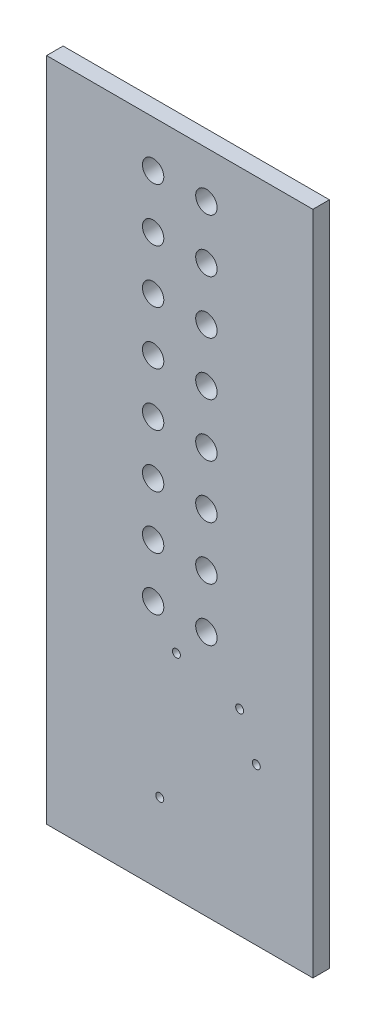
ISO-10303-21;
HEADER;
FILE_DESCRIPTION(('STEP AP214'),'2;1');
FILE_NAME('part.step','',(''),(''),'','','');
FILE_SCHEMA(('AUTOMOTIVE_DESIGN { 1 0 10303 214 1 1 1 1 }'));
ENDSEC;
DATA;
#1=APPLICATION_CONTEXT('core data for automotive mechanical design processes');
#2=APPLICATION_PROTOCOL_DEFINITION('international standard','automotive_design',2000,#1);
#3=PRODUCT_CONTEXT('',#1,'mechanical');
#4=PRODUCT('Part','Part','',(#3));
#5=PRODUCT_RELATED_PRODUCT_CATEGORY('part','',(#4));
#6=PRODUCT_DEFINITION_FORMATION('','',#4);
#7=PRODUCT_DEFINITION_CONTEXT('part definition',#1,'design');
#8=PRODUCT_DEFINITION('design','',#6,#7);
#9=PRODUCT_DEFINITION_SHAPE('','',#8);
#10=(LENGTH_UNIT() NAMED_UNIT(*) SI_UNIT(.MILLI.,.METRE.));
#11=(NAMED_UNIT(*) PLANE_ANGLE_UNIT() SI_UNIT($,.RADIAN.));
#12=(NAMED_UNIT(*) SI_UNIT($,.STERADIAN.) SOLID_ANGLE_UNIT());
#13=UNCERTAINTY_MEASURE_WITH_UNIT(LENGTH_MEASURE(1.E-05),#10,'distance_accuracy_value','');
#14=(GEOMETRIC_REPRESENTATION_CONTEXT(3) GLOBAL_UNCERTAINTY_ASSIGNED_CONTEXT((#13)) GLOBAL_UNIT_ASSIGNED_CONTEXT((#10,
#11,#12)) REPRESENTATION_CONTEXT('',''));
#15=CARTESIAN_POINT('',(0.,0.,0.));
#16=DIRECTION('',(0.,0.,1.));
#17=DIRECTION('',(1.,0.,0.));
#18=AXIS2_PLACEMENT_3D('',#15,#16,#17);
#19=CARTESIAN_POINT('',(12.7,0.,0.7874));
#20=DIRECTION('',(0.,1.,0.));
#21=DIRECTION('',(0.,0.,1.));
#22=AXIS2_PLACEMENT_3D('',#19,#20,#21);
#23=PLANE('',#22);
#24=DIRECTION('',(1.,0.,0.));
#25=VECTOR('',#24,1.);
#26=CARTESIAN_POINT('',(12.7,0.,0.));
#27=LINE('',#26,#25);
#28=CARTESIAN_POINT('',(0.,0.,0.));
#29=VERTEX_POINT('',#28);
#30=CARTESIAN_POINT('',(12.7,0.,0.));
#31=VERTEX_POINT('',#30);
#32=EDGE_CURVE('E99',#29,#31,#27,.T.);
#33=ORIENTED_EDGE('',*,*,#32,.T.);
#34=DIRECTION('',(0.,0.,-1.));
#35=VECTOR('',#34,1.);
#36=CARTESIAN_POINT('',(12.7,0.,0.7874));
#37=LINE('',#36,#35);
#38=CARTESIAN_POINT('',(12.7,0.,0.7874));
#39=VERTEX_POINT('',#38);
#40=EDGE_CURVE('E11',#39,#31,#37,.T.);
#41=ORIENTED_EDGE('',*,*,#40,.F.);
#42=DIRECTION('',(1.,0.,0.));
#43=VECTOR('',#42,1.);
#44=CARTESIAN_POINT('',(12.7,0.,0.7874));
#45=LINE('',#44,#43);
#46=CARTESIAN_POINT('',(0.,0.,0.7874));
#47=VERTEX_POINT('',#46);
#48=EDGE_CURVE('E87',#47,#39,#45,.T.);
#49=ORIENTED_EDGE('',*,*,#48,.F.);
#50=DIRECTION('',(0.,0.,-1.));
#51=VECTOR('',#50,1.);
#52=CARTESIAN_POINT('',(0.,0.,0.7874));
#53=LINE('',#52,#51);
#54=EDGE_CURVE('E95',#47,#29,#53,.T.);
#55=ORIENTED_EDGE('',*,*,#54,.T.);
#56=EDGE_LOOP('',(#33,#41,#49,#55));
#57=FACE_BOUND('',#56,.T.);
#58=ADVANCED_FACE('F36',(#57),#23,.F.);
#59=CARTESIAN_POINT('',(12.7,31.75,0.7874));
#60=DIRECTION('',(-1.,0.,0.));
#61=DIRECTION('',(0.,0.,1.));
#62=AXIS2_PLACEMENT_3D('',#59,#60,#61);
#63=PLANE('',#62);
#64=DIRECTION('',(0.,1.,0.));
#65=VECTOR('',#64,1.);
#66=CARTESIAN_POINT('',(12.7,31.75,0.));
#67=LINE('',#66,#65);
#68=CARTESIAN_POINT('',(12.7,31.75,0.));
#69=VERTEX_POINT('',#68);
#70=EDGE_CURVE('E91',#31,#69,#67,.T.);
#71=ORIENTED_EDGE('',*,*,#70,.T.);
#72=DIRECTION('',(0.,0.,-1.));
#73=VECTOR('',#72,1.);
#74=CARTESIAN_POINT('',(12.7,31.75,0.7874));
#75=LINE('',#74,#73);
#76=CARTESIAN_POINT('',(12.7,31.75,0.7874));
#77=VERTEX_POINT('',#76);
#78=EDGE_CURVE('E44',#77,#69,#75,.T.);
#79=ORIENTED_EDGE('',*,*,#78,.F.);
#80=DIRECTION('',(0.,1.,0.));
#81=VECTOR('',#80,1.);
#82=CARTESIAN_POINT('',(12.7,31.75,0.7874));
#83=LINE('',#82,#81);
#84=EDGE_CURVE('E82',#39,#77,#83,.T.);
#85=ORIENTED_EDGE('',*,*,#84,.F.);
#86=ORIENTED_EDGE('',*,*,#40,.T.);
#87=EDGE_LOOP('',(#71,#79,#85,#86));
#88=FACE_BOUND('',#87,.T.);
#89=ADVANCED_FACE('F90',(#88),#63,.F.);
#90=CARTESIAN_POINT('',(0.,31.75,0.7874));
#91=DIRECTION('',(0.,-1.,0.));
#92=DIRECTION('',(0.,0.,-1.));
#93=AXIS2_PLACEMENT_3D('',#90,#91,#92);
#94=PLANE('',#93);
#95=DIRECTION('',(-1.,0.,0.));
#96=VECTOR('',#95,1.);
#97=CARTESIAN_POINT('',(0.,31.75,0.));
#98=LINE('',#97,#96);
#99=CARTESIAN_POINT('',(0.,31.75,0.));
#100=VERTEX_POINT('',#99);
#101=EDGE_CURVE('E69',#69,#100,#98,.T.);
#102=ORIENTED_EDGE('',*,*,#101,.T.);
#103=DIRECTION('',(0.,0.,-1.));
#104=VECTOR('',#103,1.);
#105=CARTESIAN_POINT('',(0.,31.75,0.7874));
#106=LINE('',#105,#104);
#107=CARTESIAN_POINT('',(0.,31.75,0.7874));
#108=VERTEX_POINT('',#107);
#109=EDGE_CURVE('E92',#108,#100,#106,.T.);
#110=ORIENTED_EDGE('',*,*,#109,.F.);
#111=DIRECTION('',(-1.,0.,0.));
#112=VECTOR('',#111,1.);
#113=CARTESIAN_POINT('',(0.,31.75,0.7874));
#114=LINE('',#113,#112);
#115=EDGE_CURVE('E85',#77,#108,#114,.T.);
#116=ORIENTED_EDGE('',*,*,#115,.F.);
#117=ORIENTED_EDGE('',*,*,#78,.T.);
#118=EDGE_LOOP('',(#102,#110,#116,#117));
#119=FACE_BOUND('',#118,.T.);
#120=ADVANCED_FACE('F93',(#119),#94,.F.);
#121=CARTESIAN_POINT('',(0.,0.,0.7874));
#122=DIRECTION('',(1.,0.,0.));
#123=DIRECTION('',(0.,0.,-1.));
#124=AXIS2_PLACEMENT_3D('',#121,#122,#123);
#125=PLANE('',#124);
#126=DIRECTION('',(0.,-1.,0.));
#127=VECTOR('',#126,1.);
#128=CARTESIAN_POINT('',(0.,0.,0.));
#129=LINE('',#128,#127);
#130=EDGE_CURVE('E75',#100,#29,#129,.T.);
#131=ORIENTED_EDGE('',*,*,#130,.T.);
#132=ORIENTED_EDGE('',*,*,#54,.F.);
#133=DIRECTION('',(0.,-1.,0.));
#134=VECTOR('',#133,1.);
#135=CARTESIAN_POINT('',(0.,0.,0.7874));
#136=LINE('',#135,#134);
#137=EDGE_CURVE('E52',#108,#47,#136,.T.);
#138=ORIENTED_EDGE('',*,*,#137,.F.);
#139=ORIENTED_EDGE('',*,*,#109,.T.);
#140=EDGE_LOOP('',(#131,#132,#138,#139));
#141=FACE_BOUND('',#140,.T.);
#142=ADVANCED_FACE('F107',(#141),#125,.F.);
#143=CARTESIAN_POINT('',(0.,0.,0.7874));
#144=DIRECTION('',(0.,0.,-1.));
#145=DIRECTION('',(-1.,0.,0.));
#146=AXIS2_PLACEMENT_3D('',#143,#144,#145);
#147=PLANE('',#146);
#148=CARTESIAN_POINT('',(7.62,24.45,0.7874));
#149=DIRECTION('',(0.,0.,1.));
#150=DIRECTION('',(1.,0.,0.));
#151=AXIS2_PLACEMENT_3D('',#148,#149,#150);
#152=CIRCLE('',#151,0.51);
#153=CARTESIAN_POINT('',(8.13,24.45,0.7874));
#154=VERTEX_POINT('',#153);
#155=EDGE_CURVE('E147',#154,#154,#152,.T.);
#156=ORIENTED_EDGE('',*,*,#155,.F.);
#157=EDGE_LOOP('',(#156));
#158=FACE_BOUND('',#157,.T.);
#159=CARTESIAN_POINT('',(7.62,26.99,0.7874));
#160=DIRECTION('',(0.,0.,1.));
#161=DIRECTION('',(1.,0.,0.));
#162=AXIS2_PLACEMENT_3D('',#159,#160,#161);
#163=CIRCLE('',#162,0.51);
#164=CARTESIAN_POINT('',(8.13,26.99,0.7874));
#165=VERTEX_POINT('',#164);
#166=EDGE_CURVE('E170',#165,#165,#163,.T.);
#167=ORIENTED_EDGE('',*,*,#166,.F.);
#168=EDGE_LOOP('',(#167));
#169=FACE_BOUND('',#168,.T.);
#170=CARTESIAN_POINT('',(7.62,29.53,0.7874));
#171=DIRECTION('',(0.,0.,1.));
#172=DIRECTION('',(1.,0.,0.));
#173=AXIS2_PLACEMENT_3D('',#170,#171,#172);
#174=CIRCLE('',#173,0.51);
#175=CARTESIAN_POINT('',(8.13,29.53,0.7874));
#176=VERTEX_POINT('',#175);
#177=EDGE_CURVE('E171',#176,#176,#174,.T.);
#178=ORIENTED_EDGE('',*,*,#177,.F.);
#179=EDGE_LOOP('',(#178));
#180=FACE_BOUND('',#179,.T.);
#181=CARTESIAN_POINT('',(5.08,11.75,0.7874));
#182=DIRECTION('',(0.,0.,1.));
#183=DIRECTION('',(1.,0.,0.));
#184=AXIS2_PLACEMENT_3D('',#181,#182,#183);
#185=CIRCLE('',#184,0.51);
#186=CARTESIAN_POINT('',(5.59,11.75,0.7874));
#187=VERTEX_POINT('',#186);
#188=EDGE_CURVE('E182',#187,#187,#185,.T.);
#189=ORIENTED_EDGE('',*,*,#188,.F.);
#190=EDGE_LOOP('',(#189));
#191=FACE_BOUND('',#190,.T.);
#192=CARTESIAN_POINT('',(7.62,21.91,0.7874));
#193=DIRECTION('',(0.,0.,1.));
#194=DIRECTION('',(1.,0.,0.));
#195=AXIS2_PLACEMENT_3D('',#192,#193,#194);
#196=CIRCLE('',#195,0.51);
#197=CARTESIAN_POINT('',(8.13,21.91,0.7874));
#198=VERTEX_POINT('',#197);
#199=EDGE_CURVE('E146',#198,#198,#196,.T.);
#200=ORIENTED_EDGE('',*,*,#199,.F.);
#201=EDGE_LOOP('',(#200));
#202=FACE_BOUND('',#201,.T.);
#203=CARTESIAN_POINT('',(7.62,19.37,0.7874));
#204=DIRECTION('',(0.,0.,1.));
#205=DIRECTION('',(1.,0.,0.));
#206=AXIS2_PLACEMENT_3D('',#203,#204,#205);
#207=CIRCLE('',#206,0.51);
#208=CARTESIAN_POINT('',(8.13,19.37,0.7874));
#209=VERTEX_POINT('',#208);
#210=EDGE_CURVE('E153',#209,#209,#207,.T.);
#211=ORIENTED_EDGE('',*,*,#210,.F.);
#212=EDGE_LOOP('',(#211));
#213=FACE_BOUND('',#212,.T.);
#214=CARTESIAN_POINT('',(7.62,16.83,0.7874));
#215=DIRECTION('',(0.,0.,1.));
#216=DIRECTION('',(1.,0.,0.));
#217=AXIS2_PLACEMENT_3D('',#214,#215,#216);
#218=CIRCLE('',#217,0.51);
#219=CARTESIAN_POINT('',(8.13,16.83,0.7874));
#220=VERTEX_POINT('',#219);
#221=EDGE_CURVE('E159',#220,#220,#218,.T.);
#222=ORIENTED_EDGE('',*,*,#221,.F.);
#223=EDGE_LOOP('',(#222));
#224=FACE_BOUND('',#223,.T.);
#225=CARTESIAN_POINT('',(7.62,14.29,0.7874));
#226=DIRECTION('',(0.,0.,1.));
#227=DIRECTION('',(1.,0.,0.));
#228=AXIS2_PLACEMENT_3D('',#225,#226,#227);
#229=CIRCLE('',#228,0.51);
#230=CARTESIAN_POINT('',(8.13,14.29,0.7874));
#231=VERTEX_POINT('',#230);
#232=EDGE_CURVE('E140',#231,#231,#229,.T.);
#233=ORIENTED_EDGE('',*,*,#232,.F.);
#234=EDGE_LOOP('',(#233));
#235=FACE_BOUND('',#234,.T.);
#236=CARTESIAN_POINT('',(5.08,14.29,0.7874));
#237=DIRECTION('',(0.,0.,1.));
#238=DIRECTION('',(1.,0.,0.));
#239=AXIS2_PLACEMENT_3D('',#236,#237,#238);
#240=CIRCLE('',#239,0.51);
#241=CARTESIAN_POINT('',(5.59,14.29,0.7874));
#242=VERTEX_POINT('',#241);
#243=EDGE_CURVE('E183',#242,#242,#240,.T.);
#244=ORIENTED_EDGE('',*,*,#243,.F.);
#245=EDGE_LOOP('',(#244));
#246=FACE_BOUND('',#245,.T.);
#247=CARTESIAN_POINT('',(5.08,16.83,0.7874));
#248=DIRECTION('',(0.,0.,1.));
#249=DIRECTION('',(1.,0.,0.));
#250=AXIS2_PLACEMENT_3D('',#247,#248,#249);
#251=CIRCLE('',#250,0.51);
#252=CARTESIAN_POINT('',(5.59,16.83,0.7874));
#253=VERTEX_POINT('',#252);
#254=EDGE_CURVE('E224',#253,#253,#251,.T.);
#255=ORIENTED_EDGE('',*,*,#254,.F.);
#256=EDGE_LOOP('',(#255));
#257=FACE_BOUND('',#256,.T.);
#258=CARTESIAN_POINT('',(5.08,19.37,0.7874));
#259=DIRECTION('',(0.,0.,1.));
#260=DIRECTION('',(1.,0.,0.));
#261=AXIS2_PLACEMENT_3D('',#258,#259,#260);
#262=CIRCLE('',#261,0.51);
#263=CARTESIAN_POINT('',(5.59,19.37,0.7874));
#264=VERTEX_POINT('',#263);
#265=EDGE_CURVE('E218',#264,#264,#262,.T.);
#266=ORIENTED_EDGE('',*,*,#265,.F.);
#267=EDGE_LOOP('',(#266));
#268=FACE_BOUND('',#267,.T.);
#269=CARTESIAN_POINT('',(5.08,21.91,0.7874));
#270=DIRECTION('',(0.,0.,1.));
#271=DIRECTION('',(1.,0.,0.));
#272=AXIS2_PLACEMENT_3D('',#269,#270,#271);
#273=CIRCLE('',#272,0.51);
#274=CARTESIAN_POINT('',(5.59,21.91,0.7874));
#275=VERTEX_POINT('',#274);
#276=EDGE_CURVE('E212',#275,#275,#273,.T.);
#277=ORIENTED_EDGE('',*,*,#276,.F.);
#278=EDGE_LOOP('',(#277));
#279=FACE_BOUND('',#278,.T.);
#280=CARTESIAN_POINT('',(5.08,24.45,0.7874));
#281=DIRECTION('',(0.,0.,1.));
#282=DIRECTION('',(1.,0.,0.));
#283=AXIS2_PLACEMENT_3D('',#280,#281,#282);
#284=CIRCLE('',#283,0.51);
#285=CARTESIAN_POINT('',(5.59,24.45,0.7874));
#286=VERTEX_POINT('',#285);
#287=EDGE_CURVE('E206',#286,#286,#284,.T.);
#288=ORIENTED_EDGE('',*,*,#287,.F.);
#289=EDGE_LOOP('',(#288));
#290=FACE_BOUND('',#289,.T.);
#291=CARTESIAN_POINT('',(5.08,26.99,0.7874));
#292=DIRECTION('',(0.,0.,1.));
#293=DIRECTION('',(1.,0.,0.));
#294=AXIS2_PLACEMENT_3D('',#291,#292,#293);
#295=CIRCLE('',#294,0.51);
#296=CARTESIAN_POINT('',(5.59,26.99,0.7874));
#297=VERTEX_POINT('',#296);
#298=EDGE_CURVE('E200',#297,#297,#295,.T.);
#299=ORIENTED_EDGE('',*,*,#298,.F.);
#300=EDGE_LOOP('',(#299));
#301=FACE_BOUND('',#300,.T.);
#302=CARTESIAN_POINT('',(5.08,29.53,0.7874));
#303=DIRECTION('',(0.,0.,1.));
#304=DIRECTION('',(1.,0.,0.));
#305=AXIS2_PLACEMENT_3D('',#302,#303,#304);
#306=CIRCLE('',#305,0.51);
#307=CARTESIAN_POINT('',(5.59,29.53,0.7874));
#308=VERTEX_POINT('',#307);
#309=EDGE_CURVE('E194',#308,#308,#306,.T.);
#310=ORIENTED_EDGE('',*,*,#309,.F.);
#311=EDGE_LOOP('',(#310));
#312=FACE_BOUND('',#311,.T.);
#313=CARTESIAN_POINT('',(7.62,11.75,0.7874));
#314=DIRECTION('',(0.,0.,1.));
#315=DIRECTION('',(1.,0.,0.));
#316=AXIS2_PLACEMENT_3D('',#313,#314,#315);
#317=CIRCLE('',#316,0.51);
#318=CARTESIAN_POINT('',(8.13,11.75,0.7874));
#319=VERTEX_POINT('',#318);
#320=EDGE_CURVE('E117',#319,#319,#317,.T.);
#321=ORIENTED_EDGE('',*,*,#320,.F.);
#322=EDGE_LOOP('',(#321));
#323=FACE_BOUND('',#322,.T.);
#324=CARTESIAN_POINT('',(10.0013,7.4613,0.7874));
#325=DIRECTION('',(0.,0.,1.));
#326=DIRECTION('',(1.,0.,0.));
#327=AXIS2_PLACEMENT_3D('',#324,#325,#326);
#328=CIRCLE('',#327,0.1905);
#329=CARTESIAN_POINT('',(10.1918,7.4613,0.7874));
#330=VERTEX_POINT('',#329);
#331=EDGE_CURVE('E102',#330,#330,#328,.T.);
#332=ORIENTED_EDGE('',*,*,#331,.F.);
#333=EDGE_LOOP('',(#332));
#334=FACE_BOUND('',#333,.T.);
#335=CARTESIAN_POINT('',(9.2075,9.3663,0.7874));
#336=DIRECTION('',(0.,0.,1.));
#337=DIRECTION('',(1.,0.,0.));
#338=AXIS2_PLACEMENT_3D('',#335,#336,#337);
#339=CIRCLE('',#338,0.1905);
#340=CARTESIAN_POINT('',(9.398,9.3663,0.7874));
#341=VERTEX_POINT('',#340);
#342=EDGE_CURVE('E129',#341,#341,#339,.T.);
#343=ORIENTED_EDGE('',*,*,#342,.F.);
#344=EDGE_LOOP('',(#343));
#345=FACE_BOUND('',#344,.T.);
#346=CARTESIAN_POINT('',(5.3975,3.81,0.7874));
#347=DIRECTION('',(0.,0.,1.));
#348=DIRECTION('',(1.,0.,0.));
#349=AXIS2_PLACEMENT_3D('',#346,#347,#348);
#350=CIRCLE('',#349,0.1905);
#351=CARTESIAN_POINT('',(5.588,3.81,0.7874));
#352=VERTEX_POINT('',#351);
#353=EDGE_CURVE('E123',#352,#352,#350,.T.);
#354=ORIENTED_EDGE('',*,*,#353,.F.);
#355=EDGE_LOOP('',(#354));
#356=FACE_BOUND('',#355,.T.);
#357=CARTESIAN_POINT('',(6.1913,10.16,0.7874));
#358=DIRECTION('',(0.,0.,1.));
#359=DIRECTION('',(1.,0.,0.));
#360=AXIS2_PLACEMENT_3D('',#357,#358,#359);
#361=CIRCLE('',#360,0.1905);
#362=CARTESIAN_POINT('',(6.3818,10.16,0.7874));
#363=VERTEX_POINT('',#362);
#364=EDGE_CURVE('E116',#363,#363,#361,.T.);
#365=ORIENTED_EDGE('',*,*,#364,.F.);
#366=EDGE_LOOP('',(#365));
#367=FACE_BOUND('',#366,.T.);
#368=ORIENTED_EDGE('',*,*,#48,.T.);
#369=ORIENTED_EDGE('',*,*,#84,.T.);
#370=ORIENTED_EDGE('',*,*,#115,.T.);
#371=ORIENTED_EDGE('',*,*,#137,.T.);
#372=EDGE_LOOP('',(#368,#369,#370,#371));
#373=FACE_BOUND('',#372,.T.);
#374=ADVANCED_FACE('F83',(#158,#169,#180,#191,#202,#213,#224,#235,#246,#257,#268,#279,#290,#301,
#312,#323,#334,#345,#356,#367,#373),#147,.F.);
#375=CARTESIAN_POINT('',(0.,0.,0.));
#376=DIRECTION('',(0.,0.,-1.));
#377=DIRECTION('',(-1.,0.,0.));
#378=AXIS2_PLACEMENT_3D('',#375,#376,#377);
#379=PLANE('',#378);
#380=CARTESIAN_POINT('',(7.62,24.45,0.));
#381=DIRECTION('',(0.,0.,1.));
#382=DIRECTION('',(1.,0.,0.));
#383=AXIS2_PLACEMENT_3D('',#380,#381,#382);
#384=CIRCLE('',#383,0.51);
#385=CARTESIAN_POINT('',(8.13,24.45,0.));
#386=VERTEX_POINT('',#385);
#387=EDGE_CURVE('E174',#386,#386,#384,.T.);
#388=ORIENTED_EDGE('',*,*,#387,.T.);
#389=EDGE_LOOP('',(#388));
#390=FACE_BOUND('',#389,.T.);
#391=CARTESIAN_POINT('',(7.62,26.99,0.));
#392=DIRECTION('',(0.,0.,1.));
#393=DIRECTION('',(1.,0.,0.));
#394=AXIS2_PLACEMENT_3D('',#391,#392,#393);
#395=CIRCLE('',#394,0.51);
#396=CARTESIAN_POINT('',(8.13,26.99,0.));
#397=VERTEX_POINT('',#396);
#398=EDGE_CURVE('E167',#397,#397,#395,.T.);
#399=ORIENTED_EDGE('',*,*,#398,.T.);
#400=EDGE_LOOP('',(#399));
#401=FACE_BOUND('',#400,.T.);
#402=CARTESIAN_POINT('',(7.62,29.53,0.));
#403=DIRECTION('',(0.,0.,1.));
#404=DIRECTION('',(1.,0.,0.));
#405=AXIS2_PLACEMENT_3D('',#402,#403,#404);
#406=CIRCLE('',#405,0.51);
#407=CARTESIAN_POINT('',(8.13,29.53,0.));
#408=VERTEX_POINT('',#407);
#409=EDGE_CURVE('E186',#408,#408,#406,.T.);
#410=ORIENTED_EDGE('',*,*,#409,.T.);
#411=EDGE_LOOP('',(#410));
#412=FACE_BOUND('',#411,.T.);
#413=CARTESIAN_POINT('',(5.08,11.75,0.));
#414=DIRECTION('',(0.,0.,1.));
#415=DIRECTION('',(1.,0.,0.));
#416=AXIS2_PLACEMENT_3D('',#413,#414,#415);
#417=CIRCLE('',#416,0.51);
#418=CARTESIAN_POINT('',(5.59,11.75,0.));
#419=VERTEX_POINT('',#418);
#420=EDGE_CURVE('E179',#419,#419,#417,.T.);
#421=ORIENTED_EDGE('',*,*,#420,.T.);
#422=EDGE_LOOP('',(#421));
#423=FACE_BOUND('',#422,.T.);
#424=CARTESIAN_POINT('',(7.62,21.91,0.));
#425=DIRECTION('',(0.,0.,1.));
#426=DIRECTION('',(1.,0.,0.));
#427=AXIS2_PLACEMENT_3D('',#424,#425,#426);
#428=CIRCLE('',#427,0.51);
#429=CARTESIAN_POINT('',(8.13,21.91,0.));
#430=VERTEX_POINT('',#429);
#431=EDGE_CURVE('E143',#430,#430,#428,.T.);
#432=ORIENTED_EDGE('',*,*,#431,.T.);
#433=EDGE_LOOP('',(#432));
#434=FACE_BOUND('',#433,.T.);
#435=CARTESIAN_POINT('',(7.62,19.37,0.));
#436=DIRECTION('',(0.,0.,1.));
#437=DIRECTION('',(1.,0.,0.));
#438=AXIS2_PLACEMENT_3D('',#435,#436,#437);
#439=CIRCLE('',#438,0.51);
#440=CARTESIAN_POINT('',(8.13,19.37,0.));
#441=VERTEX_POINT('',#440);
#442=EDGE_CURVE('E150',#441,#441,#439,.T.);
#443=ORIENTED_EDGE('',*,*,#442,.T.);
#444=EDGE_LOOP('',(#443));
#445=FACE_BOUND('',#444,.T.);
#446=CARTESIAN_POINT('',(7.62,16.83,0.));
#447=DIRECTION('',(0.,0.,1.));
#448=DIRECTION('',(1.,0.,0.));
#449=AXIS2_PLACEMENT_3D('',#446,#447,#448);
#450=CIRCLE('',#449,0.51);
#451=CARTESIAN_POINT('',(8.13,16.83,0.));
#452=VERTEX_POINT('',#451);
#453=EDGE_CURVE('E156',#452,#452,#450,.T.);
#454=ORIENTED_EDGE('',*,*,#453,.T.);
#455=EDGE_LOOP('',(#454));
#456=FACE_BOUND('',#455,.T.);
#457=CARTESIAN_POINT('',(7.62,14.29,0.));
#458=DIRECTION('',(0.,0.,1.));
#459=DIRECTION('',(1.,0.,0.));
#460=AXIS2_PLACEMENT_3D('',#457,#458,#459);
#461=CIRCLE('',#460,0.51);
#462=CARTESIAN_POINT('',(8.13,14.29,0.));
#463=VERTEX_POINT('',#462);
#464=EDGE_CURVE('E162',#463,#463,#461,.T.);
#465=ORIENTED_EDGE('',*,*,#464,.T.);
#466=EDGE_LOOP('',(#465));
#467=FACE_BOUND('',#466,.T.);
#468=CARTESIAN_POINT('',(5.08,14.29,0.));
#469=DIRECTION('',(0.,0.,1.));
#470=DIRECTION('',(1.,0.,0.));
#471=AXIS2_PLACEMENT_3D('',#468,#469,#470);
#472=CIRCLE('',#471,0.51);
#473=CARTESIAN_POINT('',(5.59,14.29,0.));
#474=VERTEX_POINT('',#473);
#475=EDGE_CURVE('E227',#474,#474,#472,.T.);
#476=ORIENTED_EDGE('',*,*,#475,.T.);
#477=EDGE_LOOP('',(#476));
#478=FACE_BOUND('',#477,.T.);
#479=CARTESIAN_POINT('',(5.08,16.83,0.));
#480=DIRECTION('',(0.,0.,1.));
#481=DIRECTION('',(1.,0.,0.));
#482=AXIS2_PLACEMENT_3D('',#479,#480,#481);
#483=CIRCLE('',#482,0.51);
#484=CARTESIAN_POINT('',(5.59,16.83,0.));
#485=VERTEX_POINT('',#484);
#486=EDGE_CURVE('E221',#485,#485,#483,.T.);
#487=ORIENTED_EDGE('',*,*,#486,.T.);
#488=EDGE_LOOP('',(#487));
#489=FACE_BOUND('',#488,.T.);
#490=CARTESIAN_POINT('',(5.08,19.37,0.));
#491=DIRECTION('',(0.,0.,1.));
#492=DIRECTION('',(1.,0.,0.));
#493=AXIS2_PLACEMENT_3D('',#490,#491,#492);
#494=CIRCLE('',#493,0.51);
#495=CARTESIAN_POINT('',(5.59,19.37,0.));
#496=VERTEX_POINT('',#495);
#497=EDGE_CURVE('E215',#496,#496,#494,.T.);
#498=ORIENTED_EDGE('',*,*,#497,.T.);
#499=EDGE_LOOP('',(#498));
#500=FACE_BOUND('',#499,.T.);
#501=CARTESIAN_POINT('',(5.08,21.91,0.));
#502=DIRECTION('',(0.,0.,1.));
#503=DIRECTION('',(1.,0.,0.));
#504=AXIS2_PLACEMENT_3D('',#501,#502,#503);
#505=CIRCLE('',#504,0.51);
#506=CARTESIAN_POINT('',(5.59,21.91,0.));
#507=VERTEX_POINT('',#506);
#508=EDGE_CURVE('E209',#507,#507,#505,.T.);
#509=ORIENTED_EDGE('',*,*,#508,.T.);
#510=EDGE_LOOP('',(#509));
#511=FACE_BOUND('',#510,.T.);
#512=CARTESIAN_POINT('',(5.08,24.45,0.));
#513=DIRECTION('',(0.,0.,1.));
#514=DIRECTION('',(1.,0.,0.));
#515=AXIS2_PLACEMENT_3D('',#512,#513,#514);
#516=CIRCLE('',#515,0.51);
#517=CARTESIAN_POINT('',(5.59,24.45,0.));
#518=VERTEX_POINT('',#517);
#519=EDGE_CURVE('E203',#518,#518,#516,.T.);
#520=ORIENTED_EDGE('',*,*,#519,.T.);
#521=EDGE_LOOP('',(#520));
#522=FACE_BOUND('',#521,.T.);
#523=CARTESIAN_POINT('',(5.08,26.99,0.));
#524=DIRECTION('',(0.,0.,1.));
#525=DIRECTION('',(1.,0.,0.));
#526=AXIS2_PLACEMENT_3D('',#523,#524,#525);
#527=CIRCLE('',#526,0.51);
#528=CARTESIAN_POINT('',(5.59,26.99,0.));
#529=VERTEX_POINT('',#528);
#530=EDGE_CURVE('E197',#529,#529,#527,.T.);
#531=ORIENTED_EDGE('',*,*,#530,.T.);
#532=EDGE_LOOP('',(#531));
#533=FACE_BOUND('',#532,.T.);
#534=CARTESIAN_POINT('',(5.08,29.53,0.));
#535=DIRECTION('',(0.,0.,1.));
#536=DIRECTION('',(1.,0.,0.));
#537=AXIS2_PLACEMENT_3D('',#534,#535,#536);
#538=CIRCLE('',#537,0.51);
#539=CARTESIAN_POINT('',(5.59,29.53,0.));
#540=VERTEX_POINT('',#539);
#541=EDGE_CURVE('E191',#540,#540,#538,.T.);
#542=ORIENTED_EDGE('',*,*,#541,.T.);
#543=EDGE_LOOP('',(#542));
#544=FACE_BOUND('',#543,.T.);
#545=CARTESIAN_POINT('',(7.62,11.75,0.));
#546=DIRECTION('',(0.,0.,1.));
#547=DIRECTION('',(1.,0.,0.));
#548=AXIS2_PLACEMENT_3D('',#545,#546,#547);
#549=CIRCLE('',#548,0.51);
#550=CARTESIAN_POINT('',(8.13,11.75,0.));
#551=VERTEX_POINT('',#550);
#552=EDGE_CURVE('E137',#551,#551,#549,.T.);
#553=ORIENTED_EDGE('',*,*,#552,.T.);
#554=EDGE_LOOP('',(#553));
#555=FACE_BOUND('',#554,.T.);
#556=CARTESIAN_POINT('',(10.0013,7.4613,0.));
#557=DIRECTION('',(0.,0.,1.));
#558=DIRECTION('',(1.,0.,0.));
#559=AXIS2_PLACEMENT_3D('',#556,#557,#558);
#560=CIRCLE('',#559,0.1905);
#561=CARTESIAN_POINT('',(10.1918,7.4613,0.));
#562=VERTEX_POINT('',#561);
#563=EDGE_CURVE('E132',#562,#562,#560,.T.);
#564=ORIENTED_EDGE('',*,*,#563,.T.);
#565=EDGE_LOOP('',(#564));
#566=FACE_BOUND('',#565,.T.);
#567=CARTESIAN_POINT('',(9.2075,9.3663,0.));
#568=DIRECTION('',(0.,0.,1.));
#569=DIRECTION('',(1.,0.,0.));
#570=AXIS2_PLACEMENT_3D('',#567,#568,#569);
#571=CIRCLE('',#570,0.1905);
#572=CARTESIAN_POINT('',(9.398,9.3663,0.));
#573=VERTEX_POINT('',#572);
#574=EDGE_CURVE('E126',#573,#573,#571,.T.);
#575=ORIENTED_EDGE('',*,*,#574,.T.);
#576=EDGE_LOOP('',(#575));
#577=FACE_BOUND('',#576,.T.);
#578=CARTESIAN_POINT('',(5.3975,3.81,0.));
#579=DIRECTION('',(0.,0.,1.));
#580=DIRECTION('',(1.,0.,0.));
#581=AXIS2_PLACEMENT_3D('',#578,#579,#580);
#582=CIRCLE('',#581,0.1905);
#583=CARTESIAN_POINT('',(5.588,3.81,0.));
#584=VERTEX_POINT('',#583);
#585=EDGE_CURVE('E120',#584,#584,#582,.T.);
#586=ORIENTED_EDGE('',*,*,#585,.T.);
#587=EDGE_LOOP('',(#586));
#588=FACE_BOUND('',#587,.T.);
#589=CARTESIAN_POINT('',(6.1913,10.16,0.));
#590=DIRECTION('',(0.,0.,1.));
#591=DIRECTION('',(1.,0.,0.));
#592=AXIS2_PLACEMENT_3D('',#589,#590,#591);
#593=CIRCLE('',#592,0.1905);
#594=CARTESIAN_POINT('',(6.3818,10.16,0.));
#595=VERTEX_POINT('',#594);
#596=EDGE_CURVE('E113',#595,#595,#593,.T.);
#597=ORIENTED_EDGE('',*,*,#596,.T.);
#598=EDGE_LOOP('',(#597));
#599=FACE_BOUND('',#598,.T.);
#600=ORIENTED_EDGE('',*,*,#32,.F.);
#601=ORIENTED_EDGE('',*,*,#130,.F.);
#602=ORIENTED_EDGE('',*,*,#101,.F.);
#603=ORIENTED_EDGE('',*,*,#70,.F.);
#604=EDGE_LOOP('',(#600,#601,#602,#603));
#605=FACE_BOUND('',#604,.T.);
#606=ADVANCED_FACE('F110',(#390,#401,#412,#423,#434,#445,#456,#467,#478,#489,#500,#511,#522,
#533,#544,#555,#566,#577,#588,#599,#605),#379,.T.);
#607=CARTESIAN_POINT('',(6.1913,10.16,0.7874));
#608=DIRECTION('',(0.,0.,-1.));
#609=DIRECTION('',(-1.,0.,0.));
#610=AXIS2_PLACEMENT_3D('',#607,#608,#609);
#611=CYLINDRICAL_SURFACE('',#610,0.1905);
#612=ORIENTED_EDGE('',*,*,#364,.T.);
#613=EDGE_LOOP('',(#612));
#614=FACE_BOUND('',#613,.T.);
#615=ORIENTED_EDGE('',*,*,#596,.F.);
#616=EDGE_LOOP('',(#615));
#617=FACE_BOUND('',#616,.T.);
#618=ADVANCED_FACE('F262',(#614,#617),#611,.F.);
#619=CARTESIAN_POINT('',(5.3975,3.81,0.7874));
#620=DIRECTION('',(0.,0.,-1.));
#621=DIRECTION('',(-1.,0.,0.));
#622=AXIS2_PLACEMENT_3D('',#619,#620,#621);
#623=CYLINDRICAL_SURFACE('',#622,0.1905);
#624=ORIENTED_EDGE('',*,*,#353,.T.);
#625=EDGE_LOOP('',(#624));
#626=FACE_BOUND('',#625,.T.);
#627=ORIENTED_EDGE('',*,*,#585,.F.);
#628=EDGE_LOOP('',(#627));
#629=FACE_BOUND('',#628,.T.);
#630=ADVANCED_FACE('F265',(#626,#629),#623,.F.);
#631=CARTESIAN_POINT('',(9.2075,9.3663,0.7874));
#632=DIRECTION('',(0.,0.,-1.));
#633=DIRECTION('',(-1.,0.,0.));
#634=AXIS2_PLACEMENT_3D('',#631,#632,#633);
#635=CYLINDRICAL_SURFACE('',#634,0.1905);
#636=ORIENTED_EDGE('',*,*,#342,.T.);
#637=EDGE_LOOP('',(#636));
#638=FACE_BOUND('',#637,.T.);
#639=ORIENTED_EDGE('',*,*,#574,.F.);
#640=EDGE_LOOP('',(#639));
#641=FACE_BOUND('',#640,.T.);
#642=ADVANCED_FACE('F338',(#638,#641),#635,.F.);
#643=CARTESIAN_POINT('',(10.0013,7.4613,0.7874));
#644=DIRECTION('',(0.,0.,-1.));
#645=DIRECTION('',(-1.,0.,0.));
#646=AXIS2_PLACEMENT_3D('',#643,#644,#645);
#647=CYLINDRICAL_SURFACE('',#646,0.1905);
#648=ORIENTED_EDGE('',*,*,#331,.T.);
#649=EDGE_LOOP('',(#648));
#650=FACE_BOUND('',#649,.T.);
#651=ORIENTED_EDGE('',*,*,#563,.F.);
#652=EDGE_LOOP('',(#651));
#653=FACE_BOUND('',#652,.T.);
#654=ADVANCED_FACE('F350',(#650,#653),#647,.F.);
#655=CARTESIAN_POINT('',(7.62,11.75,0.7874));
#656=DIRECTION('',(0.,0.,-1.));
#657=DIRECTION('',(-1.,0.,0.));
#658=AXIS2_PLACEMENT_3D('',#655,#656,#657);
#659=CYLINDRICAL_SURFACE('',#658,0.51);
#660=ORIENTED_EDGE('',*,*,#320,.T.);
#661=EDGE_LOOP('',(#660));
#662=FACE_BOUND('',#661,.T.);
#663=ORIENTED_EDGE('',*,*,#552,.F.);
#664=EDGE_LOOP('',(#663));
#665=FACE_BOUND('',#664,.T.);
#666=ADVANCED_FACE('F360',(#662,#665),#659,.F.);
#667=CARTESIAN_POINT('',(5.08,29.53,0.7874));
#668=DIRECTION('',(0.,0.,-1.));
#669=DIRECTION('',(-1.,0.,0.));
#670=AXIS2_PLACEMENT_3D('',#667,#668,#669);
#671=CYLINDRICAL_SURFACE('',#670,0.51);
#672=ORIENTED_EDGE('',*,*,#309,.T.);
#673=EDGE_LOOP('',(#672));
#674=FACE_BOUND('',#673,.T.);
#675=ORIENTED_EDGE('',*,*,#541,.F.);
#676=EDGE_LOOP('',(#675));
#677=FACE_BOUND('',#676,.T.);
#678=ADVANCED_FACE('F380',(#674,#677),#671,.F.);
#679=CARTESIAN_POINT('',(5.08,26.99,0.7874));
#680=DIRECTION('',(0.,0.,-1.));
#681=DIRECTION('',(-1.,0.,0.));
#682=AXIS2_PLACEMENT_3D('',#679,#680,#681);
#683=CYLINDRICAL_SURFACE('',#682,0.51);
#684=ORIENTED_EDGE('',*,*,#298,.T.);
#685=EDGE_LOOP('',(#684));
#686=FACE_BOUND('',#685,.T.);
#687=ORIENTED_EDGE('',*,*,#530,.F.);
#688=EDGE_LOOP('',(#687));
#689=FACE_BOUND('',#688,.T.);
#690=ADVANCED_FACE('F390',(#686,#689),#683,.F.);
#691=CARTESIAN_POINT('',(5.08,24.45,0.7874));
#692=DIRECTION('',(0.,0.,-1.));
#693=DIRECTION('',(-1.,0.,0.));
#694=AXIS2_PLACEMENT_3D('',#691,#692,#693);
#695=CYLINDRICAL_SURFACE('',#694,0.51);
#696=ORIENTED_EDGE('',*,*,#287,.T.);
#697=EDGE_LOOP('',(#696));
#698=FACE_BOUND('',#697,.T.);
#699=ORIENTED_EDGE('',*,*,#519,.F.);
#700=EDGE_LOOP('',(#699));
#701=FACE_BOUND('',#700,.T.);
#702=ADVANCED_FACE('F400',(#698,#701),#695,.F.);
#703=CARTESIAN_POINT('',(5.08,21.91,0.7874));
#704=DIRECTION('',(0.,0.,-1.));
#705=DIRECTION('',(-1.,0.,0.));
#706=AXIS2_PLACEMENT_3D('',#703,#704,#705);
#707=CYLINDRICAL_SURFACE('',#706,0.51);
#708=ORIENTED_EDGE('',*,*,#276,.T.);
#709=EDGE_LOOP('',(#708));
#710=FACE_BOUND('',#709,.T.);
#711=ORIENTED_EDGE('',*,*,#508,.F.);
#712=EDGE_LOOP('',(#711));
#713=FACE_BOUND('',#712,.T.);
#714=ADVANCED_FACE('F410',(#710,#713),#707,.F.);
#715=CARTESIAN_POINT('',(5.08,19.37,0.7874));
#716=DIRECTION('',(0.,0.,-1.));
#717=DIRECTION('',(-1.,0.,0.));
#718=AXIS2_PLACEMENT_3D('',#715,#716,#717);
#719=CYLINDRICAL_SURFACE('',#718,0.51);
#720=ORIENTED_EDGE('',*,*,#265,.T.);
#721=EDGE_LOOP('',(#720));
#722=FACE_BOUND('',#721,.T.);
#723=ORIENTED_EDGE('',*,*,#497,.F.);
#724=EDGE_LOOP('',(#723));
#725=FACE_BOUND('',#724,.T.);
#726=ADVANCED_FACE('F420',(#722,#725),#719,.F.);
#727=CARTESIAN_POINT('',(5.08,16.83,0.7874));
#728=DIRECTION('',(0.,0.,-1.));
#729=DIRECTION('',(-1.,0.,0.));
#730=AXIS2_PLACEMENT_3D('',#727,#728,#729);
#731=CYLINDRICAL_SURFACE('',#730,0.51);
#732=ORIENTED_EDGE('',*,*,#254,.T.);
#733=EDGE_LOOP('',(#732));
#734=FACE_BOUND('',#733,.T.);
#735=ORIENTED_EDGE('',*,*,#486,.F.);
#736=EDGE_LOOP('',(#735));
#737=FACE_BOUND('',#736,.T.);
#738=ADVANCED_FACE('F430',(#734,#737),#731,.F.);
#739=CARTESIAN_POINT('',(5.08,14.29,0.7874));
#740=DIRECTION('',(0.,0.,-1.));
#741=DIRECTION('',(-1.,0.,0.));
#742=AXIS2_PLACEMENT_3D('',#739,#740,#741);
#743=CYLINDRICAL_SURFACE('',#742,0.51);
#744=ORIENTED_EDGE('',*,*,#243,.T.);
#745=EDGE_LOOP('',(#744));
#746=FACE_BOUND('',#745,.T.);
#747=ORIENTED_EDGE('',*,*,#475,.F.);
#748=EDGE_LOOP('',(#747));
#749=FACE_BOUND('',#748,.T.);
#750=ADVANCED_FACE('F233',(#746,#749),#743,.F.);
#751=CARTESIAN_POINT('',(7.62,14.29,0.7874));
#752=DIRECTION('',(0.,0.,-1.));
#753=DIRECTION('',(-1.,0.,0.));
#754=AXIS2_PLACEMENT_3D('',#751,#752,#753);
#755=CYLINDRICAL_SURFACE('',#754,0.51);
#756=ORIENTED_EDGE('',*,*,#232,.T.);
#757=EDGE_LOOP('',(#756));
#758=FACE_BOUND('',#757,.T.);
#759=ORIENTED_EDGE('',*,*,#464,.F.);
#760=EDGE_LOOP('',(#759));
#761=FACE_BOUND('',#760,.T.);
#762=ADVANCED_FACE('F449',(#758,#761),#755,.F.);
#763=CARTESIAN_POINT('',(7.62,16.83,0.7874));
#764=DIRECTION('',(0.,0.,-1.));
#765=DIRECTION('',(-1.,0.,0.));
#766=AXIS2_PLACEMENT_3D('',#763,#764,#765);
#767=CYLINDRICAL_SURFACE('',#766,0.51);
#768=ORIENTED_EDGE('',*,*,#221,.T.);
#769=EDGE_LOOP('',(#768));
#770=FACE_BOUND('',#769,.T.);
#771=ORIENTED_EDGE('',*,*,#453,.F.);
#772=EDGE_LOOP('',(#771));
#773=FACE_BOUND('',#772,.T.);
#774=ADVANCED_FACE('F458',(#770,#773),#767,.F.);
#775=CARTESIAN_POINT('',(7.62,19.37,0.7874));
#776=DIRECTION('',(0.,0.,-1.));
#777=DIRECTION('',(-1.,0.,0.));
#778=AXIS2_PLACEMENT_3D('',#775,#776,#777);
#779=CYLINDRICAL_SURFACE('',#778,0.51);
#780=ORIENTED_EDGE('',*,*,#210,.T.);
#781=EDGE_LOOP('',(#780));
#782=FACE_BOUND('',#781,.T.);
#783=ORIENTED_EDGE('',*,*,#442,.F.);
#784=EDGE_LOOP('',(#783));
#785=FACE_BOUND('',#784,.T.);
#786=ADVANCED_FACE('F468',(#782,#785),#779,.F.);
#787=CARTESIAN_POINT('',(7.62,21.91,0.7874));
#788=DIRECTION('',(0.,0.,-1.));
#789=DIRECTION('',(-1.,0.,0.));
#790=AXIS2_PLACEMENT_3D('',#787,#788,#789);
#791=CYLINDRICAL_SURFACE('',#790,0.51);
#792=ORIENTED_EDGE('',*,*,#199,.T.);
#793=EDGE_LOOP('',(#792));
#794=FACE_BOUND('',#793,.T.);
#795=ORIENTED_EDGE('',*,*,#431,.F.);
#796=EDGE_LOOP('',(#795));
#797=FACE_BOUND('',#796,.T.);
#798=ADVANCED_FACE('F478',(#794,#797),#791,.F.);
#799=CARTESIAN_POINT('',(5.08,11.75,0.7874));
#800=DIRECTION('',(0.,0.,-1.));
#801=DIRECTION('',(-1.,0.,0.));
#802=AXIS2_PLACEMENT_3D('',#799,#800,#801);
#803=CYLINDRICAL_SURFACE('',#802,0.51);
#804=ORIENTED_EDGE('',*,*,#188,.T.);
#805=EDGE_LOOP('',(#804));
#806=FACE_BOUND('',#805,.T.);
#807=ORIENTED_EDGE('',*,*,#420,.F.);
#808=EDGE_LOOP('',(#807));
#809=FACE_BOUND('',#808,.T.);
#810=ADVANCED_FACE('F488',(#806,#809),#803,.F.);
#811=CARTESIAN_POINT('',(7.62,29.53,0.7874));
#812=DIRECTION('',(0.,0.,-1.));
#813=DIRECTION('',(-1.,0.,0.));
#814=AXIS2_PLACEMENT_3D('',#811,#812,#813);
#815=CYLINDRICAL_SURFACE('',#814,0.51);
#816=ORIENTED_EDGE('',*,*,#177,.T.);
#817=EDGE_LOOP('',(#816));
#818=FACE_BOUND('',#817,.T.);
#819=ORIENTED_EDGE('',*,*,#409,.F.);
#820=EDGE_LOOP('',(#819));
#821=FACE_BOUND('',#820,.T.);
#822=ADVANCED_FACE('F498',(#818,#821),#815,.F.);
#823=CARTESIAN_POINT('',(7.62,26.99,0.7874));
#824=DIRECTION('',(0.,0.,-1.));
#825=DIRECTION('',(-1.,0.,0.));
#826=AXIS2_PLACEMENT_3D('',#823,#824,#825);
#827=CYLINDRICAL_SURFACE('',#826,0.51);
#828=ORIENTED_EDGE('',*,*,#166,.T.);
#829=EDGE_LOOP('',(#828));
#830=FACE_BOUND('',#829,.T.);
#831=ORIENTED_EDGE('',*,*,#398,.F.);
#832=EDGE_LOOP('',(#831));
#833=FACE_BOUND('',#832,.T.);
#834=ADVANCED_FACE('F508',(#830,#833),#827,.F.);
#835=CARTESIAN_POINT('',(7.62,24.45,0.7874));
#836=DIRECTION('',(0.,0.,-1.));
#837=DIRECTION('',(-1.,0.,0.));
#838=AXIS2_PLACEMENT_3D('',#835,#836,#837);
#839=CYLINDRICAL_SURFACE('',#838,0.51);
#840=ORIENTED_EDGE('',*,*,#155,.T.);
#841=EDGE_LOOP('',(#840));
#842=FACE_BOUND('',#841,.T.);
#843=ORIENTED_EDGE('',*,*,#387,.F.);
#844=EDGE_LOOP('',(#843));
#845=FACE_BOUND('',#844,.T.);
#846=ADVANCED_FACE('F518',(#842,#845),#839,.F.);
#847=CLOSED_SHELL('',(#58,#89,#120,#142,#374,#606,#618,#630,#642,#654,#666,#678,#690,#702,#714,
#726,#738,#750,#762,#774,#786,#798,#810,#822,#834,#846));
#848=MANIFOLD_SOLID_BREP('B2',#847);
#849=ADVANCED_BREP_SHAPE_REPRESENTATION('',(#18,#848),#14);
#850=SHAPE_DEFINITION_REPRESENTATION(#9,#849);
ENDSEC;
END-ISO-10303-21;
